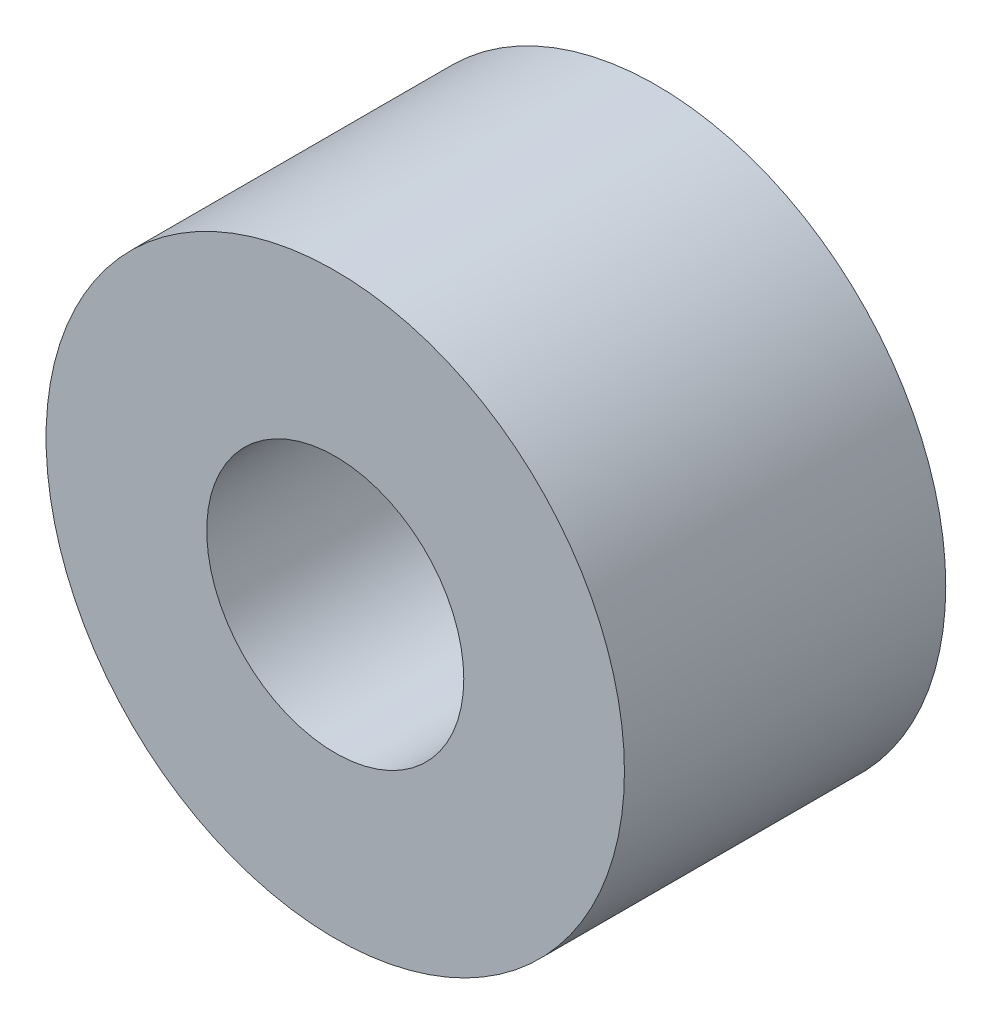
from build123d import *

# Parameters (mm, degrees)
ESQUISSE1_R          = 4.5
ESQUISSE1_R_2        = 2
BASE_EXTRUSION_DEPTH = 5


with BuildPart() as part:
    # Esquisse1 → Base-Extrusion (new body)
    with BuildSketch(Plane.XY):
        Circle(ESQUISSE1_R)
        Circle(ESQUISSE1_R_2, mode=Mode.SUBTRACT)
    extrude(amount=BASE_EXTRUSION_DEPTH)


solid = part.part
